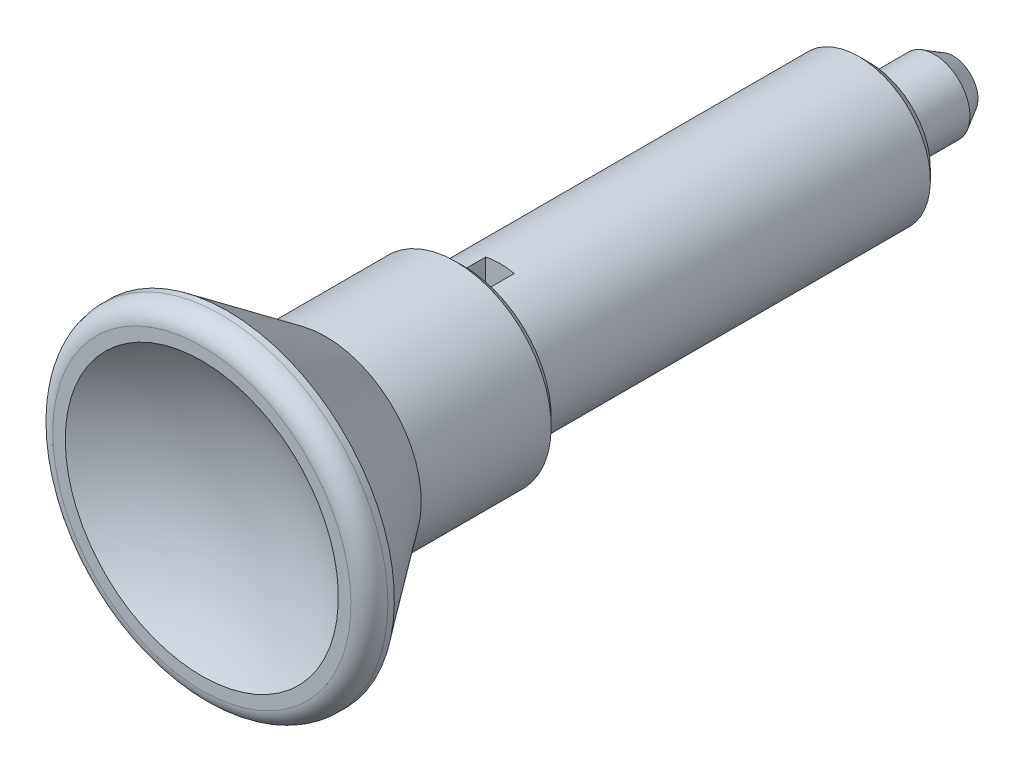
ISO-10303-21;
HEADER;
FILE_DESCRIPTION(('STEP AP214'),'2;1');
FILE_NAME('part.step','',(''),(''),'','','');
FILE_SCHEMA(('AUTOMOTIVE_DESIGN { 1 0 10303 214 1 1 1 1 }'));
ENDSEC;
DATA;
#1=APPLICATION_CONTEXT('core data for automotive mechanical design processes');
#2=APPLICATION_PROTOCOL_DEFINITION('international standard','automotive_design',2000,#1);
#3=PRODUCT_CONTEXT('',#1,'mechanical');
#4=PRODUCT('Part','Part','',(#3));
#5=PRODUCT_RELATED_PRODUCT_CATEGORY('part','',(#4));
#6=PRODUCT_DEFINITION_FORMATION('','',#4);
#7=PRODUCT_DEFINITION_CONTEXT('part definition',#1,'design');
#8=PRODUCT_DEFINITION('design','',#6,#7);
#9=PRODUCT_DEFINITION_SHAPE('','',#8);
#10=(LENGTH_UNIT() NAMED_UNIT(*) SI_UNIT(.MILLI.,.METRE.));
#11=(NAMED_UNIT(*) PLANE_ANGLE_UNIT() SI_UNIT($,.RADIAN.));
#12=(NAMED_UNIT(*) SI_UNIT($,.STERADIAN.) SOLID_ANGLE_UNIT());
#13=UNCERTAINTY_MEASURE_WITH_UNIT(LENGTH_MEASURE(1.E-05),#10,'distance_accuracy_value','');
#14=(GEOMETRIC_REPRESENTATION_CONTEXT(3) GLOBAL_UNCERTAINTY_ASSIGNED_CONTEXT((#13)) GLOBAL_UNIT_ASSIGNED_CONTEXT((#10,
#11,#12)) REPRESENTATION_CONTEXT('',''));
#15=CARTESIAN_POINT('',(0.,0.,0.));
#16=DIRECTION('',(0.,0.,1.));
#17=DIRECTION('',(1.,0.,0.));
#18=AXIS2_PLACEMENT_3D('',#15,#16,#17);
#19=CARTESIAN_POINT('',(0.6,8.,15.5));
#20=DIRECTION('',(0.,0.,1.));
#21=DIRECTION('',(0.,1.,0.));
#22=AXIS2_PLACEMENT_3D('',#19,#20,#21);
#23=PLANE('',#22);
#24=DIRECTION('',(0.,-1.,0.));
#25=VECTOR('',#24,1.);
#26=CARTESIAN_POINT('',(0.6,8.,15.5));
#27=LINE('',#26,#25);
#28=CARTESIAN_POINT('',(0.6,2.93938769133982,15.5));
#29=VERTEX_POINT('',#28);
#30=CARTESIAN_POINT('',(0.6,1.37477270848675,15.5));
#31=VERTEX_POINT('',#30);
#32=EDGE_CURVE('E96',#29,#31,#27,.T.);
#33=ORIENTED_EDGE('',*,*,#32,.F.);
#34=CARTESIAN_POINT('',(0.,0.,15.5));
#35=DIRECTION('',(0.,0.,1.));
#36=DIRECTION('',(0.,1.,0.));
#37=AXIS2_PLACEMENT_3D('',#34,#35,#36);
#38=CIRCLE('',#37,3.);
#39=CARTESIAN_POINT('',(-0.6,2.93938769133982,15.5));
#40=VERTEX_POINT('',#39);
#41=EDGE_CURVE('E84',#40,#29,#38,.F.);
#42=ORIENTED_EDGE('',*,*,#41,.F.);
#43=DIRECTION('',(0.,1.,0.));
#44=VECTOR('',#43,1.);
#45=CARTESIAN_POINT('',(-0.6,8.,15.5));
#46=LINE('',#45,#44);
#47=CARTESIAN_POINT('',(-0.6,1.37477270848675,15.5));
#48=VERTEX_POINT('',#47);
#49=EDGE_CURVE('E81',#48,#40,#46,.T.);
#50=ORIENTED_EDGE('',*,*,#49,.F.);
#51=CARTESIAN_POINT('',(0.,0.,15.5));
#52=DIRECTION('',(0.,0.,1.));
#53=DIRECTION('',(0.,1.,0.));
#54=AXIS2_PLACEMENT_3D('',#51,#52,#53);
#55=CIRCLE('',#54,1.5);
#56=EDGE_CURVE('E78',#31,#48,#55,.T.);
#57=ORIENTED_EDGE('',*,*,#56,.F.);
#58=EDGE_LOOP('',(#33,#42,#50,#57));
#59=FACE_BOUND('',#58,.T.);
#60=ADVANCED_FACE('F14',(#59),#23,.T.);
#61=CARTESIAN_POINT('',(0.6,8.,15.5));
#62=DIRECTION('',(0.,0.,1.));
#63=DIRECTION('',(0.,1.,0.));
#64=AXIS2_PLACEMENT_3D('',#61,#62,#63);
#65=PLANE('',#64);
#66=DIRECTION('',(0.,1.,0.));
#67=VECTOR('',#66,1.);
#68=CARTESIAN_POINT('',(-0.6,8.,15.5));
#69=LINE('',#68,#67);
#70=CARTESIAN_POINT('',(-0.6,-2.93938769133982,15.5));
#71=VERTEX_POINT('',#70);
#72=CARTESIAN_POINT('',(-0.6,-1.37477270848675,15.5));
#73=VERTEX_POINT('',#72);
#74=EDGE_CURVE('E211',#71,#73,#69,.T.);
#75=ORIENTED_EDGE('',*,*,#74,.F.);
#76=CARTESIAN_POINT('',(0.,0.,15.5));
#77=DIRECTION('',(0.,0.,1.));
#78=DIRECTION('',(0.,1.,0.));
#79=AXIS2_PLACEMENT_3D('',#76,#77,#78);
#80=CIRCLE('',#79,3.);
#81=CARTESIAN_POINT('',(0.6,-2.93938769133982,15.5));
#82=VERTEX_POINT('',#81);
#83=EDGE_CURVE('E202',#82,#71,#80,.F.);
#84=ORIENTED_EDGE('',*,*,#83,.F.);
#85=DIRECTION('',(0.,-1.,0.));
#86=VECTOR('',#85,1.);
#87=CARTESIAN_POINT('',(0.6,8.,15.5));
#88=LINE('',#87,#86);
#89=CARTESIAN_POINT('',(0.6,-1.37477270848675,15.5));
#90=VERTEX_POINT('',#89);
#91=EDGE_CURVE('E215',#90,#82,#88,.T.);
#92=ORIENTED_EDGE('',*,*,#91,.F.);
#93=CARTESIAN_POINT('',(0.,0.,15.5));
#94=DIRECTION('',(0.,0.,1.));
#95=DIRECTION('',(0.,1.,0.));
#96=AXIS2_PLACEMENT_3D('',#93,#94,#95);
#97=CIRCLE('',#96,1.5);
#98=EDGE_CURVE('E105',#73,#90,#97,.T.);
#99=ORIENTED_EDGE('',*,*,#98,.F.);
#100=EDGE_LOOP('',(#75,#84,#92,#99));
#101=FACE_BOUND('',#100,.T.);
#102=ADVANCED_FACE('F387',(#101),#65,.T.);
#103=CARTESIAN_POINT('',(-0.6,8.,15.5));
#104=DIRECTION('',(1.,0.,0.));
#105=DIRECTION('',(0.,1.,0.));
#106=AXIS2_PLACEMENT_3D('',#103,#104,#105);
#107=PLANE('',#106);
#108=ORIENTED_EDGE('',*,*,#49,.T.);
#109=DIRECTION('',(0.,0.,1.));
#110=VECTOR('',#109,1.);
#111=CARTESIAN_POINT('',(-0.6,2.93938769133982,0.));
#112=LINE('',#111,#110);
#113=CARTESIAN_POINT('',(-0.6,2.93938769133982,17.));
#114=VERTEX_POINT('',#113);
#115=EDGE_CURVE('E207',#114,#40,#112,.F.);
#116=ORIENTED_EDGE('',*,*,#115,.F.);
#117=DIRECTION('',(0.,1.,0.));
#118=VECTOR('',#117,1.);
#119=CARTESIAN_POINT('',(-0.6,0.,17.));
#120=LINE('',#119,#118);
#121=CARTESIAN_POINT('',(-0.6,1.37477270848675,17.));
#122=VERTEX_POINT('',#121);
#123=EDGE_CURVE('E93',#114,#122,#120,.F.);
#124=ORIENTED_EDGE('',*,*,#123,.T.);
#125=DIRECTION('',(0.,0.,1.));
#126=VECTOR('',#125,1.);
#127=CARTESIAN_POINT('',(-0.6,1.37477270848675,-3.5));
#128=LINE('',#127,#126);
#129=EDGE_CURVE('E90',#48,#122,#128,.T.);
#130=ORIENTED_EDGE('',*,*,#129,.F.);
#131=EDGE_LOOP('',(#108,#116,#124,#130));
#132=FACE_BOUND('',#131,.T.);
#133=ADVANCED_FACE('F91',(#132),#107,.T.);
#134=CARTESIAN_POINT('',(0.,0.,-3.5));
#135=DIRECTION('',(0.,0.,1.));
#136=DIRECTION('',(0.,1.,0.));
#137=AXIS2_PLACEMENT_3D('',#134,#135,#136);
#138=CYLINDRICAL_SURFACE('',#137,1.5);
#139=ORIENTED_EDGE('',*,*,#129,.T.);
#140=CARTESIAN_POINT('',(0.,0.,17.));
#141=DIRECTION('',(0.,0.,1.));
#142=DIRECTION('',(0.,1.,0.));
#143=AXIS2_PLACEMENT_3D('',#140,#141,#142);
#144=CIRCLE('',#143,1.5);
#145=CARTESIAN_POINT('',(0.6,1.37477270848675,17.));
#146=VERTEX_POINT('',#145);
#147=EDGE_CURVE('E201',#122,#146,#144,.F.);
#148=ORIENTED_EDGE('',*,*,#147,.T.);
#149=DIRECTION('',(0.,0.,1.));
#150=VECTOR('',#149,1.);
#151=CARTESIAN_POINT('',(0.6,1.37477270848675,17.));
#152=LINE('',#151,#150);
#153=EDGE_CURVE('E100',#31,#146,#152,.T.);
#154=ORIENTED_EDGE('',*,*,#153,.F.);
#155=ORIENTED_EDGE('',*,*,#56,.T.);
#156=EDGE_LOOP('',(#139,#148,#154,#155));
#157=FACE_BOUND('',#156,.T.);
#158=ADVANCED_FACE('F98',(#157),#138,.T.);
#159=CARTESIAN_POINT('',(0.6,8.,17.));
#160=DIRECTION('',(-1.,0.,0.));
#161=DIRECTION('',(0.,-1.,0.));
#162=AXIS2_PLACEMENT_3D('',#159,#160,#161);
#163=PLANE('',#162);
#164=DIRECTION('',(0.,1.,0.));
#165=VECTOR('',#164,1.);
#166=CARTESIAN_POINT('',(0.6,0.,17.));
#167=LINE('',#166,#165);
#168=CARTESIAN_POINT('',(0.6,2.93938769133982,17.));
#169=VERTEX_POINT('',#168);
#170=EDGE_CURVE('E199',#146,#169,#167,.T.);
#171=ORIENTED_EDGE('',*,*,#170,.T.);
#172=DIRECTION('',(0.,0.,1.));
#173=VECTOR('',#172,1.);
#174=CARTESIAN_POINT('',(0.6,2.93938769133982,0.));
#175=LINE('',#174,#173);
#176=EDGE_CURVE('E216',#29,#169,#175,.T.);
#177=ORIENTED_EDGE('',*,*,#176,.F.);
#178=ORIENTED_EDGE('',*,*,#32,.T.);
#179=ORIENTED_EDGE('',*,*,#153,.T.);
#180=EDGE_LOOP('',(#171,#177,#178,#179));
#181=FACE_BOUND('',#180,.T.);
#182=ADVANCED_FACE('F360',(#181),#163,.T.);
#183=CARTESIAN_POINT('',(0.6,8.,17.));
#184=DIRECTION('',(-1.,0.,0.));
#185=DIRECTION('',(0.,-1.,0.));
#186=AXIS2_PLACEMENT_3D('',#183,#184,#185);
#187=PLANE('',#186);
#188=ORIENTED_EDGE('',*,*,#91,.T.);
#189=DIRECTION('',(0.,0.,1.));
#190=VECTOR('',#189,1.);
#191=CARTESIAN_POINT('',(0.6,-2.93938769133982,0.));
#192=LINE('',#191,#190);
#193=CARTESIAN_POINT('',(0.6,-2.93938769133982,17.));
#194=VERTEX_POINT('',#193);
#195=EDGE_CURVE('E219',#194,#82,#192,.F.);
#196=ORIENTED_EDGE('',*,*,#195,.F.);
#197=DIRECTION('',(0.,1.,0.));
#198=VECTOR('',#197,1.);
#199=CARTESIAN_POINT('',(0.6,0.,17.));
#200=LINE('',#199,#198);
#201=CARTESIAN_POINT('',(0.6,-1.37477270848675,17.));
#202=VERTEX_POINT('',#201);
#203=EDGE_CURVE('E196',#194,#202,#200,.T.);
#204=ORIENTED_EDGE('',*,*,#203,.T.);
#205=DIRECTION('',(0.,0.,1.));
#206=VECTOR('',#205,1.);
#207=CARTESIAN_POINT('',(0.6,-1.37477270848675,-3.5));
#208=LINE('',#207,#206);
#209=EDGE_CURVE('E212',#90,#202,#208,.T.);
#210=ORIENTED_EDGE('',*,*,#209,.F.);
#211=EDGE_LOOP('',(#188,#196,#204,#210));
#212=FACE_BOUND('',#211,.T.);
#213=ADVANCED_FACE('F350',(#212),#187,.T.);
#214=CARTESIAN_POINT('',(0.,0.,-3.5));
#215=DIRECTION('',(0.,0.,1.));
#216=DIRECTION('',(0.,1.,0.));
#217=AXIS2_PLACEMENT_3D('',#214,#215,#216);
#218=CYLINDRICAL_SURFACE('',#217,1.5);
#219=DIRECTION('',(0.,0.,1.));
#220=VECTOR('',#219,1.);
#221=CARTESIAN_POINT('',(-0.6,-1.37477270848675,15.5));
#222=LINE('',#221,#220);
#223=CARTESIAN_POINT('',(-0.6,-1.37477270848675,17.));
#224=VERTEX_POINT('',#223);
#225=EDGE_CURVE('E208',#73,#224,#222,.T.);
#226=ORIENTED_EDGE('',*,*,#225,.F.);
#227=ORIENTED_EDGE('',*,*,#98,.T.);
#228=ORIENTED_EDGE('',*,*,#209,.T.);
#229=CARTESIAN_POINT('',(0.,0.,17.));
#230=DIRECTION('',(0.,0.,1.));
#231=DIRECTION('',(0.,1.,0.));
#232=AXIS2_PLACEMENT_3D('',#229,#230,#231);
#233=CIRCLE('',#232,1.5);
#234=EDGE_CURVE('E195',#202,#224,#233,.F.);
#235=ORIENTED_EDGE('',*,*,#234,.T.);
#236=EDGE_LOOP('',(#226,#227,#228,#235));
#237=FACE_BOUND('',#236,.T.);
#238=ADVANCED_FACE('F341',(#237),#218,.T.);
#239=CARTESIAN_POINT('',(-0.6,8.,15.5));
#240=DIRECTION('',(1.,0.,0.));
#241=DIRECTION('',(0.,1.,0.));
#242=AXIS2_PLACEMENT_3D('',#239,#240,#241);
#243=PLANE('',#242);
#244=DIRECTION('',(0.,1.,0.));
#245=VECTOR('',#244,1.);
#246=CARTESIAN_POINT('',(-0.6,0.,17.));
#247=LINE('',#246,#245);
#248=CARTESIAN_POINT('',(-0.6,-2.93938769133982,17.));
#249=VERTEX_POINT('',#248);
#250=EDGE_CURVE('E33',#224,#249,#247,.F.);
#251=ORIENTED_EDGE('',*,*,#250,.T.);
#252=DIRECTION('',(0.,0.,1.));
#253=VECTOR('',#252,1.);
#254=CARTESIAN_POINT('',(-0.6,-2.93938769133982,0.));
#255=LINE('',#254,#253);
#256=EDGE_CURVE('E205',#71,#249,#255,.T.);
#257=ORIENTED_EDGE('',*,*,#256,.F.);
#258=ORIENTED_EDGE('',*,*,#74,.T.);
#259=ORIENTED_EDGE('',*,*,#225,.T.);
#260=EDGE_LOOP('',(#251,#257,#258,#259));
#261=FACE_BOUND('',#260,.T.);
#262=ADVANCED_FACE('F332',(#261),#243,.T.);
#263=CARTESIAN_POINT('',(0.,0.,0.));
#264=DIRECTION('',(0.,0.,1.));
#265=DIRECTION('',(0.,1.,0.));
#266=AXIS2_PLACEMENT_3D('',#263,#264,#265);
#267=CYLINDRICAL_SURFACE('',#266,3.);
#268=ORIENTED_EDGE('',*,*,#195,.T.);
#269=ORIENTED_EDGE('',*,*,#83,.T.);
#270=ORIENTED_EDGE('',*,*,#256,.T.);
#271=CARTESIAN_POINT('',(0.,0.,17.));
#272=DIRECTION('',(0.,0.,1.));
#273=DIRECTION('',(0.,1.,0.));
#274=AXIS2_PLACEMENT_3D('',#271,#272,#273);
#275=CIRCLE('',#274,3.);
#276=EDGE_CURVE('E140',#249,#114,#275,.F.);
#277=ORIENTED_EDGE('',*,*,#276,.T.);
#278=ORIENTED_EDGE('',*,*,#115,.T.);
#279=ORIENTED_EDGE('',*,*,#41,.T.);
#280=ORIENTED_EDGE('',*,*,#176,.T.);
#281=CARTESIAN_POINT('',(0.,0.,17.));
#282=DIRECTION('',(0.,0.,1.));
#283=DIRECTION('',(0.,1.,0.));
#284=AXIS2_PLACEMENT_3D('',#281,#282,#283);
#285=CIRCLE('',#284,3.);
#286=EDGE_CURVE('E198',#169,#194,#285,.F.);
#287=ORIENTED_EDGE('',*,*,#286,.T.);
#288=EDGE_LOOP('',(#268,#269,#270,#277,#278,#279,#280,#287));
#289=FACE_BOUND('',#288,.T.);
#290=CARTESIAN_POINT('',(0.,0.,0.46));
#291=DIRECTION('',(0.,0.,1.));
#292=DIRECTION('',(0.,1.,0.));
#293=AXIS2_PLACEMENT_3D('',#290,#291,#292);
#294=CIRCLE('',#293,3.);
#295=CARTESIAN_POINT('',(0.,3.,0.46));
#296=VERTEX_POINT('',#295);
#297=EDGE_CURVE('E87',#296,#296,#294,.T.);
#298=ORIENTED_EDGE('',*,*,#297,.T.);
#299=EDGE_LOOP('',(#298));
#300=FACE_BOUND('',#299,.T.);
#301=ADVANCED_FACE('F162',(#289,#300),#267,.T.);
#302=CARTESIAN_POINT('',(0.,0.,36.2));
#303=DIRECTION('',(1.,0.,0.));
#304=DIRECTION('',(0.,-1.,0.));
#305=AXIS2_PLACEMENT_3D('',#302,#303,#304);
#306=SPHERICAL_SURFACE('',#305,10.);
#307=CARTESIAN_POINT('',(0.,-5.72363520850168,28.));
#308=CARTESIAN_POINT('',(0.160807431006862,-5.72363636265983,28.));
#309=CARTESIAN_POINT('',(0.32159592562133,-5.71685551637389,28.));
#310=CARTESIAN_POINT('',(0.642083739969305,-5.68977946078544,28.));
#311=CARTESIAN_POINT('',(0.801782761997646,-5.66948069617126,28.));
#312=CARTESIAN_POINT('',(1.11904321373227,-5.61548397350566,28.));
#313=CARTESIAN_POINT('',(1.27660261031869,-5.58177408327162,28.));
#314=CARTESIAN_POINT('',(1.58837766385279,-5.50118075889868,28.));
#315=CARTESIAN_POINT('',(1.74259207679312,-5.4542925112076,28.));
#316=CARTESIAN_POINT('',(2.04639002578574,-5.34772649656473,28.));
#317=CARTESIAN_POINT('',(2.19597736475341,-5.28805957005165,28.));
#318=CARTESIAN_POINT('',(2.48964848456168,-5.15631261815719,28.));
#319=CARTESIAN_POINT('',(2.6337302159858,-5.08422802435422,28.));
#320=CARTESIAN_POINT('',(2.91521966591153,-4.92822198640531,28.));
#321=CARTESIAN_POINT('',(3.05263145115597,-4.84430787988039,28.));
#322=CARTESIAN_POINT('',(3.31994934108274,-4.66517233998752,28.));
#323=CARTESIAN_POINT('',(3.44985265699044,-4.56994674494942,28.));
#324=CARTESIAN_POINT('',(3.70114169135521,-4.36891670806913,28.));
#325=CARTESIAN_POINT('',(3.82252965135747,-4.26311506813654,28.));
#326=CARTESIAN_POINT('',(4.05600625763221,-4.04162285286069,28.));
#327=CARTESIAN_POINT('',(4.16809145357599,-3.92592864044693,28.));
#328=CARTESIAN_POINT('',(4.38207998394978,-3.68554745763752,28.));
#329=CARTESIAN_POINT('',(4.48398666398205,-3.56086346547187,28.));
#330=CARTESIAN_POINT('',(4.67697163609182,-3.3033074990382,28.));
#331=CARTESIAN_POINT('',(4.76804591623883,-3.170432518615,28.));
#332=CARTESIAN_POINT('',(4.93864148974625,-2.89753415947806,28.));
#333=CARTESIAN_POINT('',(5.01816724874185,-2.75751357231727,28.));
#334=CARTESIAN_POINT('',(5.16516989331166,-2.47121903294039,28.));
#335=CARTESIAN_POINT('',(5.2326423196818,-2.3249427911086,28.));
#336=CARTESIAN_POINT('',(5.35499943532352,-2.02727986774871,28.));
#337=CARTESIAN_POINT('',(5.40988878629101,-1.87589510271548,28.));
#338=CARTESIAN_POINT('',(5.50674021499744,-1.56898679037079,28.));
#339=CARTESIAN_POINT('',(5.54869751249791,-1.41346173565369,28.));
#340=CARTESIAN_POINT('',(5.61934383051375,-1.09947530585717,28.));
#341=CARTESIAN_POINT('',(5.64803771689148,-0.941015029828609,28.));
#342=CARTESIAN_POINT('',(5.69199213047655,-0.622226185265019,28.));
#343=CARTESIAN_POINT('',(5.70724769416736,-0.461896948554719,28.));
#344=CARTESIAN_POINT('',(5.73261157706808,0.0200663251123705,28.));
#345=CARTESIAN_POINT('',(5.72239370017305,0.343017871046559,28.));
#346=CARTESIAN_POINT('',(5.64788102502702,0.982445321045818,28.));
#347=CARTESIAN_POINT('',(5.5835862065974,1.29892122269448,28.));
#348=CARTESIAN_POINT('',(5.40277811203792,1.91663457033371,28.));
#349=CARTESIAN_POINT('',(5.28626478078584,2.21787200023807,28.));
#350=CARTESIAN_POINT('',(5.00431820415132,2.79649753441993,28.));
#351=CARTESIAN_POINT('',(4.83888497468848,3.07388564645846,28.));
#352=CARTESIAN_POINT('',(4.4637972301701,3.59695416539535,28.));
#353=CARTESIAN_POINT('',(4.25414273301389,3.84263458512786,28.));
#354=CARTESIAN_POINT('',(3.796563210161,4.2953094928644,28.));
#355=CARTESIAN_POINT('',(3.54863817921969,4.50230397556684,28.));
#356=CARTESIAN_POINT('',(3.02155560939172,4.87173216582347,28.));
#357=CARTESIAN_POINT('',(2.7423980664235,5.03416586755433,28.));
#358=CARTESIAN_POINT('',(2.16077492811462,5.30986113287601,28.));
#359=CARTESIAN_POINT('',(1.85830933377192,5.42312269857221,28.));
#360=CARTESIAN_POINT('',(1.23865621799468,5.59725861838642,28.));
#361=CARTESIAN_POINT('',(0.921468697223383,5.65813297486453,28.));
#362=CARTESIAN_POINT('',(0.281375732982,5.72576641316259,28.));
#363=CARTESIAN_POINT('',(-0.0415297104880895,5.73252549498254,28.));
#364=CARTESIAN_POINT('',(-0.68389219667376,5.69173654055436,28.));
#365=CARTESIAN_POINT('',(-1.00334923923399,5.64418850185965,28.));
#366=CARTESIAN_POINT('',(-1.62974648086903,5.49613496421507,28.));
#367=CARTESIAN_POINT('',(-1.93668667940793,5.39562946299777,28.));
#368=CARTESIAN_POINT('',(-2.52933703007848,5.14451437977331,28.));
#369=CARTESIAN_POINT('',(-2.81504718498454,4.99390480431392,28.));
#370=CARTESIAN_POINT('',(-3.35712705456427,4.64685580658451,28.));
#371=CARTESIAN_POINT('',(-3.61349677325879,4.4504163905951,28.));
#372=CARTESIAN_POINT('',(-4.08961807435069,4.01728823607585,28.));
#373=CARTESIAN_POINT('',(-4.30936964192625,3.78059948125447,28.));
#374=CARTESIAN_POINT('',(-4.70601744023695,3.27367551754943,28.));
#375=CARTESIAN_POINT('',(-4.88291365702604,3.00344029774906,28.));
#376=CARTESIAN_POINT('',(-5.18882533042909,2.43715468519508,28.));
#377=CARTESIAN_POINT('',(-5.31784083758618,2.14110431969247,28.));
#378=CARTESIAN_POINT('',(-5.52434238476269,1.53136936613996,28.));
#379=CARTESIAN_POINT('',(-5.60182844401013,1.21768478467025,28.));
#380=CARTESIAN_POINT('',(-5.67775041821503,0.741063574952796,28.));
#381=CARTESIAN_POINT('',(-5.69633902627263,0.581086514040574,28.));
#382=CARTESIAN_POINT('',(-5.71997908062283,0.260151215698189,28.));
#383=CARTESIAN_POINT('',(-5.72503552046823,0.0991933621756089,28.));
#384=CARTESIAN_POINT('',(-5.72156943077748,-0.22262392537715,28.));
#385=CARTESIAN_POINT('',(-5.71304191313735,-0.383483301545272,28.));
#386=CARTESIAN_POINT('',(-5.68247012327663,-0.703855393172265,28.));
#387=CARTESIAN_POINT('',(-5.66043084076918,-0.863368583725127,28.));
#388=CARTESIAN_POINT('',(-5.60298439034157,-1.18002989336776,28.));
#389=CARTESIAN_POINT('',(-5.56757226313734,-1.33717711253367,28.));
#390=CARTESIAN_POINT('',(-5.48364862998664,-1.64787176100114,28.));
#391=CARTESIAN_POINT('',(-5.43514196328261,-1.80142049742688,28.));
#392=CARTESIAN_POINT('',(-5.32534671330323,-2.10394548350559,28.));
#393=CARTESIAN_POINT('',(-5.26405317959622,-2.25291993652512,28.));
#394=CARTESIAN_POINT('',(-5.12915652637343,-2.54512049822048,28.));
#395=CARTESIAN_POINT('',(-5.05555795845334,-2.68834870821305,28.));
#396=CARTESIAN_POINT('',(-4.89653218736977,-2.9681432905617,28.));
#397=CARTESIAN_POINT('',(-4.81110109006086,-3.10470744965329,28.));
#398=CARTESIAN_POINT('',(-4.62906996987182,-3.37010300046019,28.));
#399=CARTESIAN_POINT('',(-4.53247408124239,-3.49893722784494,28.));
#400=CARTESIAN_POINT('',(-4.32874747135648,-3.74804508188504,28.));
#401=CARTESIAN_POINT('',(-4.22161397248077,-3.86831643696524,28.));
#402=CARTESIAN_POINT('',(-3.99763671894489,-4.09936315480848,28.));
#403=CARTESIAN_POINT('',(-3.88079656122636,-4.21014200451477,28.));
#404=CARTESIAN_POINT('',(-3.63812684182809,-4.42153169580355,28.));
#405=CARTESIAN_POINT('',(-3.51229176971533,-4.52213621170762,28.));
#406=CARTESIAN_POINT('',(-3.25263946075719,-4.71234836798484,28.));
#407=CARTESIAN_POINT('',(-3.11882518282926,-4.80196004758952,28.));
#408=CARTESIAN_POINT('',(-2.84400709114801,-4.96966373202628,28.));
#409=CARTESIAN_POINT('',(-2.70299729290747,-5.0477459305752,28.));
#410=CARTESIAN_POINT('',(-2.41495020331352,-5.19171760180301,28.));
#411=CARTESIAN_POINT('',(-2.26791513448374,-5.25761152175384,28.));
#412=CARTESIAN_POINT('',(-1.96894533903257,-5.37672030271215,28.));
#413=CARTESIAN_POINT('',(-1.81701509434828,-5.42994640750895,28.));
#414=CARTESIAN_POINT('',(-1.50926303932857,-5.52340348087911,28.));
#415=CARTESIAN_POINT('',(-1.35344226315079,-5.56363786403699,28.));
#416=CARTESIAN_POINT('',(-0.999794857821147,-5.63921310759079,28.));
#417=CARTESIAN_POINT('',(-0.801164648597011,-5.6708445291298,28.));
#418=CARTESIAN_POINT('',(-0.401679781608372,-5.7130548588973,28.));
#419=CARTESIAN_POINT('',(-0.200825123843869,-5.72363376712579,28.));
#420=CARTESIAN_POINT('',(0.,-5.72363520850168,28.));
#421=B_SPLINE_CURVE_WITH_KNOTS('',3,(#307,#308,#309,#310,#311,#312,#313,#314,#315,#316,#317,
#318,#319,#320,#321,#322,#323,#324,#325,#326,#327,#328,#329,#330,#331,#332,#333,#334,#335,#336,
#337,#338,#339,#340,#341,#342,#343,#344,#345,#346,#347,#348,#349,#350,#351,#352,#353,#354,#355,
#356,#357,#358,#359,#360,#361,#362,#363,#364,#365,#366,#367,#368,#369,#370,#371,#372,#373,#374,
#375,#376,#377,#378,#379,#380,#381,#382,#383,#384,#385,#386,#387,#388,#389,#390,#391,#392,#393,
#394,#395,#396,#397,#398,#399,#400,#401,#402,#403,#404,#405,#406,#407,#408,#409,#410,#411,#412,
#413,#414,#415,#416,#417,#418,#419,#420),.UNSPECIFIED.,.T.,.F.,(4,2,2,2,2,2,2,2,2,2,2,2,2,2,2,2,
2,2,2,2,2,2,2,2,2,2,2,2,2,2,2,2,2,2,2,2,2,2,2,2,2,2,2,2,2,2,2,2,2,2,2,2,2,2,2,2,4),(0.,
0.482246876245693,0.964620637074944,1.44742454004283,1.93040502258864,2.41297739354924,
2.89572768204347,3.37817983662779,3.86081004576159,4.34331272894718,4.82599357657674,
5.30851524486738,5.79121506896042,6.27372774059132,6.75641855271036,7.23893025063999,
7.72162009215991,8.20413271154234,8.68682347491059,9.65116698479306,10.6155108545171,
11.5798557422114,12.5442003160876,13.5085444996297,14.4728888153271,15.4372332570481,
16.4015776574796,17.3659220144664,18.3302663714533,19.2946107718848,20.2589552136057,
21.2232995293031,22.1876437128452,23.1519882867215,24.1163331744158,25.0806770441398,
26.0450205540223,26.5277113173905,27.0102239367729,27.4929137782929,27.9754254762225,
28.4581162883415,28.9406289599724,29.4233287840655,29.9058504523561,30.3885312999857,
30.8710339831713,31.3536641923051,31.8361163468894,32.3188666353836,32.8014390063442,
33.28441948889,33.7672233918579,34.2495971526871,34.7318440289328,35.3341003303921,
35.9363566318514),.UNSPECIFIED.);
#422=CARTESIAN_POINT('',(0.,-5.72363520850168,28.));
#423=VERTEX_POINT('',#422);
#424=EDGE_CURVE('E132',#423,#423,#421,.T.);
#425=ORIENTED_EDGE('',*,*,#424,.T.);
#426=EDGE_LOOP('',(#425));
#427=FACE_BOUND('',#426,.T.);
#428=ADVANCED_FACE('F142',(#427),#306,.F.);
#429=CARTESIAN_POINT('',(-3.64644660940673,0.,17.));
#430=DIRECTION('',(0.,0.,1.));
#431=DIRECTION('',(0.,1.,0.));
#432=AXIS2_PLACEMENT_3D('',#429,#430,#431);
#433=PLANE('',#432);
#434=CARTESIAN_POINT('',(0.,0.,17.));
#435=DIRECTION('',(0.,0.,1.));
#436=DIRECTION('',(0.,1.,0.));
#437=AXIS2_PLACEMENT_3D('',#434,#435,#436);
#438=CIRCLE('',#437,3.64644660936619);
#439=CARTESIAN_POINT('',(0.,3.64644660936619,17.));
#440=VERTEX_POINT('',#439);
#441=EDGE_CURVE('E129',#440,#440,#438,.T.);
#442=ORIENTED_EDGE('',*,*,#441,.F.);
#443=EDGE_LOOP('',(#442));
#444=FACE_BOUND('',#443,.T.);
#445=ORIENTED_EDGE('',*,*,#250,.F.);
#446=ORIENTED_EDGE('',*,*,#234,.F.);
#447=ORIENTED_EDGE('',*,*,#203,.F.);
#448=ORIENTED_EDGE('',*,*,#286,.F.);
#449=ORIENTED_EDGE('',*,*,#170,.F.);
#450=ORIENTED_EDGE('',*,*,#147,.F.);
#451=ORIENTED_EDGE('',*,*,#123,.F.);
#452=ORIENTED_EDGE('',*,*,#276,.F.);
#453=EDGE_LOOP('',(#445,#446,#447,#448,#449,#450,#451,#452));
#454=FACE_BOUND('',#453,.T.);
#455=ADVANCED_FACE('F152',(#444,#454),#433,.F.);
#456=CARTESIAN_POINT('',(-5.72363520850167,0.,28.));
#457=DIRECTION('',(0.,0.,-1.));
#458=DIRECTION('',(0.,-1.,0.));
#459=AXIS2_PLACEMENT_3D('',#456,#457,#458);
#460=PLANE('',#459);
#461=ORIENTED_EDGE('',*,*,#424,.F.);
#462=EDGE_LOOP('',(#461));
#463=FACE_BOUND('',#462,.T.);
#464=CARTESIAN_POINT('',(0.,0.,28.));
#465=DIRECTION('',(0.,0.,-1.));
#466=DIRECTION('',(0.,-1.,0.));
#467=AXIS2_PLACEMENT_3D('',#464,#465,#466);
#468=CIRCLE('',#467,6.24999999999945);
#469=CARTESIAN_POINT('',(0.,-6.24999999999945,28.));
#470=VERTEX_POINT('',#469);
#471=EDGE_CURVE('E125',#470,#470,#468,.T.);
#472=ORIENTED_EDGE('',*,*,#471,.F.);
#473=EDGE_LOOP('',(#472));
#474=FACE_BOUND('',#473,.T.);
#475=ADVANCED_FACE('F147',(#463,#474),#460,.F.);
#476=CARTESIAN_POINT('',(0.,0.,17.3535533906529));
#477=DIRECTION('',(0.,0.,1.));
#478=DIRECTION('',(0.,1.,0.));
#479=AXIS2_PLACEMENT_3D('',#476,#477,#478);
#480=CONICAL_SURFACE('',#479,4.0000000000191,0.785398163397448);
#481=CARTESIAN_POINT('',(0.,0.,17.3535533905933));
#482=DIRECTION('',(0.,0.,1.));
#483=DIRECTION('',(0.,1.,0.));
#484=AXIS2_PLACEMENT_3D('',#481,#482,#483);
#485=CIRCLE('',#484,4.);
#486=CARTESIAN_POINT('',(0.,4.,17.3535533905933));
#487=VERTEX_POINT('',#486);
#488=EDGE_CURVE('E128',#487,#487,#485,.T.);
#489=ORIENTED_EDGE('',*,*,#488,.F.);
#490=EDGE_LOOP('',(#489));
#491=FACE_BOUND('',#490,.T.);
#492=ORIENTED_EDGE('',*,*,#441,.T.);
#493=EDGE_LOOP('',(#492));
#494=FACE_BOUND('',#493,.T.);
#495=ADVANCED_FACE('F151',(#491,#494),#480,.T.);
#496=CARTESIAN_POINT('',(0.,0.,27.2015640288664));
#497=DIRECTION('',(0.,0.,-1.));
#498=DIRECTION('',(0.,-1.,0.));
#499=AXIS2_PLACEMENT_3D('',#496,#497,#498);
#500=TOROIDAL_SURFACE('',#499,6.2,0.8);
#501=CARTESIAN_POINT('',(0.,0.,27.2015653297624));
#502=DIRECTION('',(0.,0.,1.));
#503=DIRECTION('',(0.,1.,0.));
#504=AXIS2_PLACEMENT_3D('',#501,#502,#503);
#505=CIRCLE('',#504,6.99999999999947);
#506=CARTESIAN_POINT('',(0.,6.99999999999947,27.2015653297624));
#507=VERTEX_POINT('',#506);
#508=EDGE_CURVE('E428',#507,#507,#505,.F.);
#509=ORIENTED_EDGE('',*,*,#508,.F.);
#510=EDGE_LOOP('',(#509));
#511=FACE_BOUND('',#510,.T.);
#512=ORIENTED_EDGE('',*,*,#471,.T.);
#513=EDGE_LOOP('',(#512));
#514=FACE_BOUND('',#513,.T.);
#515=ADVANCED_FACE('F184',(#511,#514),#500,.T.);
#516=CARTESIAN_POINT('',(0.,0.,-3.5));
#517=DIRECTION('',(0.,0.,1.));
#518=DIRECTION('',(0.,1.,0.));
#519=AXIS2_PLACEMENT_3D('',#516,#517,#518);
#520=CYLINDRICAL_SURFACE('',#519,4.);
#521=CARTESIAN_POINT('',(0.,0.,22.8));
#522=DIRECTION('',(0.,0.,1.));
#523=DIRECTION('',(0.,1.,0.));
#524=AXIS2_PLACEMENT_3D('',#521,#522,#523);
#525=CIRCLE('',#524,4.);
#526=CARTESIAN_POINT('',(0.,4.,22.8));
#527=VERTEX_POINT('',#526);
#528=EDGE_CURVE('E24',#527,#527,#525,.T.);
#529=ORIENTED_EDGE('',*,*,#528,.F.);
#530=EDGE_LOOP('',(#529));
#531=FACE_BOUND('',#530,.T.);
#532=ORIENTED_EDGE('',*,*,#488,.T.);
#533=EDGE_LOOP('',(#532));
#534=FACE_BOUND('',#533,.T.);
#535=ADVANCED_FACE('F178',(#531,#534),#520,.T.);
#536=CARTESIAN_POINT('',(0.,0.,-3.5));
#537=DIRECTION('',(0.,0.,1.));
#538=DIRECTION('',(0.,1.,0.));
#539=AXIS2_PLACEMENT_3D('',#536,#537,#538);
#540=CYLINDRICAL_SURFACE('',#539,6.99999999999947);
#541=ORIENTED_EDGE('',*,*,#508,.T.);
#542=EDGE_LOOP('',(#541));
#543=FACE_BOUND('',#542,.T.);
#544=CARTESIAN_POINT('',(0.,0.,26.9291457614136));
#545=DIRECTION('',(0.,0.,1.));
#546=DIRECTION('',(0.,1.,0.));
#547=AXIS2_PLACEMENT_3D('',#544,#545,#546);
#548=CIRCLE('',#547,7.);
#549=CARTESIAN_POINT('',(0.,7.,26.9291457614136));
#550=VERTEX_POINT('',#549);
#551=EDGE_CURVE('E9',#550,#550,#548,.F.);
#552=ORIENTED_EDGE('',*,*,#551,.F.);
#553=EDGE_LOOP('',(#552));
#554=FACE_BOUND('',#553,.T.);
#555=ADVANCED_FACE('F168',(#543,#554),#540,.T.);
#556=CARTESIAN_POINT('',(0.,0.,26.9291457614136));
#557=DIRECTION('',(0.,0.,1.));
#558=DIRECTION('',(0.,1.,0.));
#559=AXIS2_PLACEMENT_3D('',#556,#557,#558);
#560=CONICAL_SURFACE('',#559,7.,0.628318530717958);
#561=ORIENTED_EDGE('',*,*,#551,.T.);
#562=EDGE_LOOP('',(#561));
#563=FACE_BOUND('',#562,.T.);
#564=ORIENTED_EDGE('',*,*,#528,.T.);
#565=EDGE_LOOP('',(#564));
#566=FACE_BOUND('',#565,.T.);
#567=ADVANCED_FACE('F166',(#563,#566),#560,.T.);
#568=CARTESIAN_POINT('',(-1.03811978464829,0.,-3.5));
#569=DIRECTION('',(0.,0.,1.));
#570=DIRECTION('',(0.,1.,0.));
#571=AXIS2_PLACEMENT_3D('',#568,#569,#570);
#572=PLANE('',#571);
#573=CARTESIAN_POINT('',(0.,0.,-3.49999999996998));
#574=DIRECTION('',(0.,0.,1.));
#575=DIRECTION('',(0.,1.,0.));
#576=AXIS2_PLACEMENT_3D('',#573,#574,#575);
#577=CIRCLE('',#576,1.03811978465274);
#578=CARTESIAN_POINT('',(0.,1.03811978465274,-3.49999999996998));
#579=VERTEX_POINT('',#578);
#580=EDGE_CURVE('E18',#579,#579,#577,.T.);
#581=ORIENTED_EDGE('',*,*,#580,.F.);
#582=EDGE_LOOP('',(#581));
#583=FACE_BOUND('',#582,.T.);
#584=ADVANCED_FACE('F16',(#583),#572,.F.);
#585=CARTESIAN_POINT('',(0.,0.,-2.69999999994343));
#586=DIRECTION('',(0.,0.,1.));
#587=DIRECTION('',(0.,1.,0.));
#588=AXIS2_PLACEMENT_3D('',#585,#586,#587);
#589=CONICAL_SURFACE('',#588,1.50000000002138,0.523598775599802);
#590=CARTESIAN_POINT('',(0.,0.,-2.7));
#591=DIRECTION('',(0.,0.,1.));
#592=DIRECTION('',(0.,1.,0.));
#593=AXIS2_PLACEMENT_3D('',#590,#591,#592);
#594=CIRCLE('',#593,1.5);
#595=CARTESIAN_POINT('',(0.,1.5,-2.7));
#596=VERTEX_POINT('',#595);
#597=EDGE_CURVE('E111',#596,#596,#594,.T.);
#598=ORIENTED_EDGE('',*,*,#597,.F.);
#599=EDGE_LOOP('',(#598));
#600=FACE_BOUND('',#599,.T.);
#601=ORIENTED_EDGE('',*,*,#580,.T.);
#602=EDGE_LOOP('',(#601));
#603=FACE_BOUND('',#602,.T.);
#604=ADVANCED_FACE('F176',(#600,#603),#589,.T.);
#605=CARTESIAN_POINT('',(0.,0.,-3.5));
#606=DIRECTION('',(0.,0.,1.));
#607=DIRECTION('',(0.,1.,0.));
#608=AXIS2_PLACEMENT_3D('',#605,#606,#607);
#609=CYLINDRICAL_SURFACE('',#608,1.5);
#610=CARTESIAN_POINT('',(0.,0.,0.));
#611=DIRECTION('',(0.,0.,1.));
#612=DIRECTION('',(0.,1.,0.));
#613=AXIS2_PLACEMENT_3D('',#610,#611,#612);
#614=CIRCLE('',#613,1.5);
#615=CARTESIAN_POINT('',(0.,1.5,0.));
#616=VERTEX_POINT('',#615);
#617=EDGE_CURVE('E109',#616,#616,#614,.F.);
#618=ORIENTED_EDGE('',*,*,#617,.T.);
#619=EDGE_LOOP('',(#618));
#620=FACE_BOUND('',#619,.T.);
#621=ORIENTED_EDGE('',*,*,#597,.T.);
#622=EDGE_LOOP('',(#621));
#623=FACE_BOUND('',#622,.T.);
#624=ADVANCED_FACE('F239',(#620,#623),#609,.T.);
#625=CARTESIAN_POINT('',(-2.54,0.,0.));
#626=DIRECTION('',(0.,0.,1.));
#627=DIRECTION('',(0.,1.,0.));
#628=AXIS2_PLACEMENT_3D('',#625,#626,#627);
#629=PLANE('',#628);
#630=CARTESIAN_POINT('',(0.,0.,6.09373662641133E-11));
#631=DIRECTION('',(0.,0.,1.));
#632=DIRECTION('',(0.,1.,0.));
#633=AXIS2_PLACEMENT_3D('',#630,#631,#632);
#634=CIRCLE('',#633,2.53999999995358);
#635=CARTESIAN_POINT('',(0.,2.53999999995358,6.09373662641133E-11));
#636=VERTEX_POINT('',#635);
#637=EDGE_CURVE('E107',#636,#636,#634,.T.);
#638=ORIENTED_EDGE('',*,*,#637,.F.);
#639=EDGE_LOOP('',(#638));
#640=FACE_BOUND('',#639,.T.);
#641=ORIENTED_EDGE('',*,*,#617,.F.);
#642=EDGE_LOOP('',(#641));
#643=FACE_BOUND('',#642,.T.);
#644=ADVANCED_FACE('F233',(#640,#643),#629,.F.);
#645=CARTESIAN_POINT('',(0.,0.,0.460000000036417));
#646=DIRECTION('',(0.,0.,1.));
#647=DIRECTION('',(0.,1.,0.));
#648=AXIS2_PLACEMENT_3D('',#645,#646,#647);
#649=CONICAL_SURFACE('',#648,2.99999999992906,0.785398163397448);
#650=ORIENTED_EDGE('',*,*,#297,.F.);
#651=EDGE_LOOP('',(#650));
#652=FACE_BOUND('',#651,.T.);
#653=ORIENTED_EDGE('',*,*,#637,.T.);
#654=EDGE_LOOP('',(#653));
#655=FACE_BOUND('',#654,.T.);
#656=ADVANCED_FACE('F230',(#652,#655),#649,.T.);
#657=CLOSED_SHELL('',(#60,#102,#133,#158,#182,#213,#238,#262,#301,#428,#455,#475,#495,#515,#535,
#555,#567,#584,#604,#624,#644,#656));
#658=MANIFOLD_SOLID_BREP('B1',#657);
#659=ADVANCED_BREP_SHAPE_REPRESENTATION('',(#18,#658),#14);
#660=SHAPE_DEFINITION_REPRESENTATION(#9,#659);
ENDSEC;
END-ISO-10303-21;
